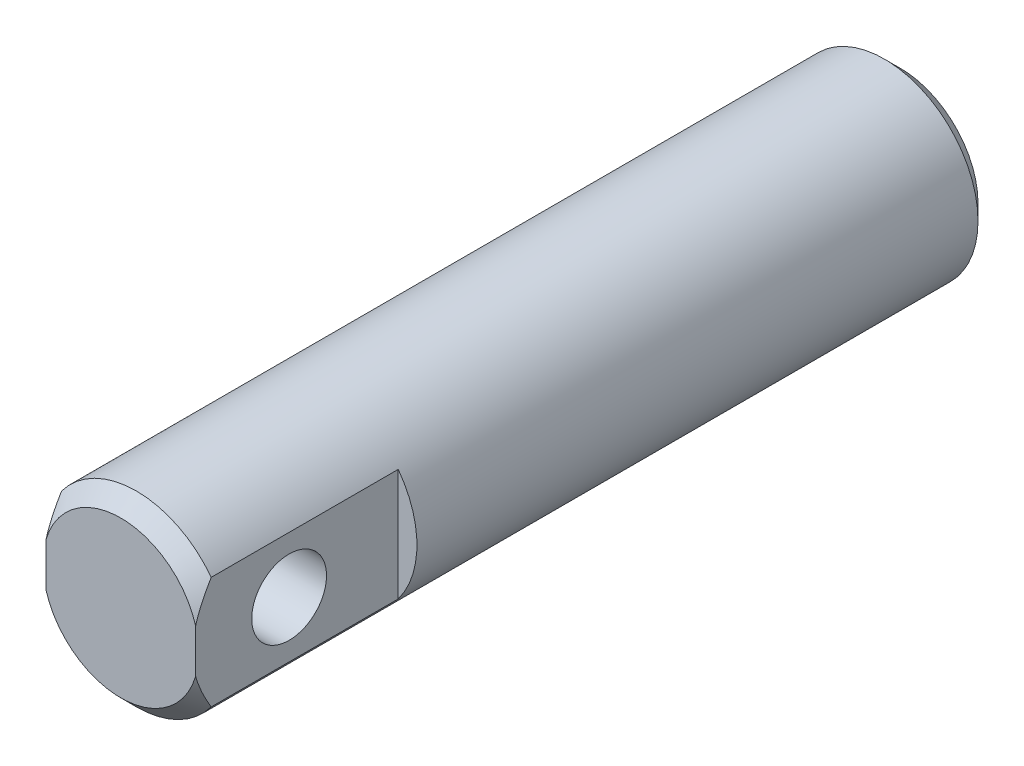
from build123d import *

# Parameters (mm, degrees)
ESQUISSE1_R             = 3
BASE_EXTRUSION_DEPTH    = 25
CHANFREIN2_SIZE         = 0.5
ESQUISSE2_W             = 2
ESQUISSE2_H             = 6
ENL_V_MAT_EXTRU_1_DEPTH = 6.5
ESQUISSE5_W             = 2
ESQUISSE5_H             = 6
ENL_V_MAT_EXTRU_3_DEPTH = 6.5
ESQUISSE4_R             = 1.2
ENL_V_MAT_EXTRU_2_DEPTH = 26.751893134
ENL_V_MAT_EXTRU_4_DEPTH = 3.5


with BuildPart() as part:
    # Esquisse1 → Base-Extrusion (new body)
    with BuildSketch(Plane.XY):
        with Locations(Location((0, 0, 0), (0, 0, 216.869897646))):
            Circle(ESQUISSE1_R)
    extrude(amount=BASE_EXTRUSION_DEPTH)

    # Chanfrein2
    chanfrein2_edges = [part.edges().sort_by_distance(p)[0] for p in [
        (2.4, 1.8, 0),
        (2.4, 1.8, 25),
    ]]
    chamfer(chanfrein2_edges, length=CHANFREIN2_SIZE)

    # Esquisse2 → Enl_v. mat.-Extru.1 (cut)
    with BuildSketch(Plane.XY.offset(25)):
        with Locations((3.4, 0)):
            Rectangle(ESQUISSE2_W, ESQUISSE2_H)
    extrude(amount=-ENL_V_MAT_EXTRU_1_DEPTH, mode=Mode.SUBTRACT)

    # Esquisse5 → Enl_v. mat.-Extru.3 (cut)
    with BuildSketch(Plane.XY.offset(25)):
        with Locations((-3.4, 0)):
            Rectangle(ESQUISSE5_W, ESQUISSE5_H)
    extrude(amount=-ENL_V_MAT_EXTRU_3_DEPTH, mode=Mode.SUBTRACT)

    # Esquisse4 → Enl_v. mat.-Extru.2 (cut, through all)
    with BuildSketch(Plane(origin=(2.4, 0, 0), x_dir=(0, 0, -1), z_dir=(1, 0, 0))):
        with Locations(Location((-22, 0, 0), (0, 0, 90))):
            Circle(ESQUISSE4_R)
    extrude(amount=-ENL_V_MAT_EXTRU_2_DEPTH, mode=Mode.SUBTRACT)

    # Esquisse6 → Enl_v. mat.-Extru.4 (cut)
    with BuildSketch(Plane(origin=(0, 0, 0), x_dir=(-1, 0, 0), z_dir=(0, 0, -1))):
        Polygon((-2, 0), (-0.999257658, 1.732479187), (0.999257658, 1.732479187), (2, 0), (0.999257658, -1.732479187), (-0.999257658, -1.732479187), align=None)
    extrude(amount=-ENL_V_MAT_EXTRU_4_DEPTH, mode=Mode.SUBTRACT)


solid = part.part
